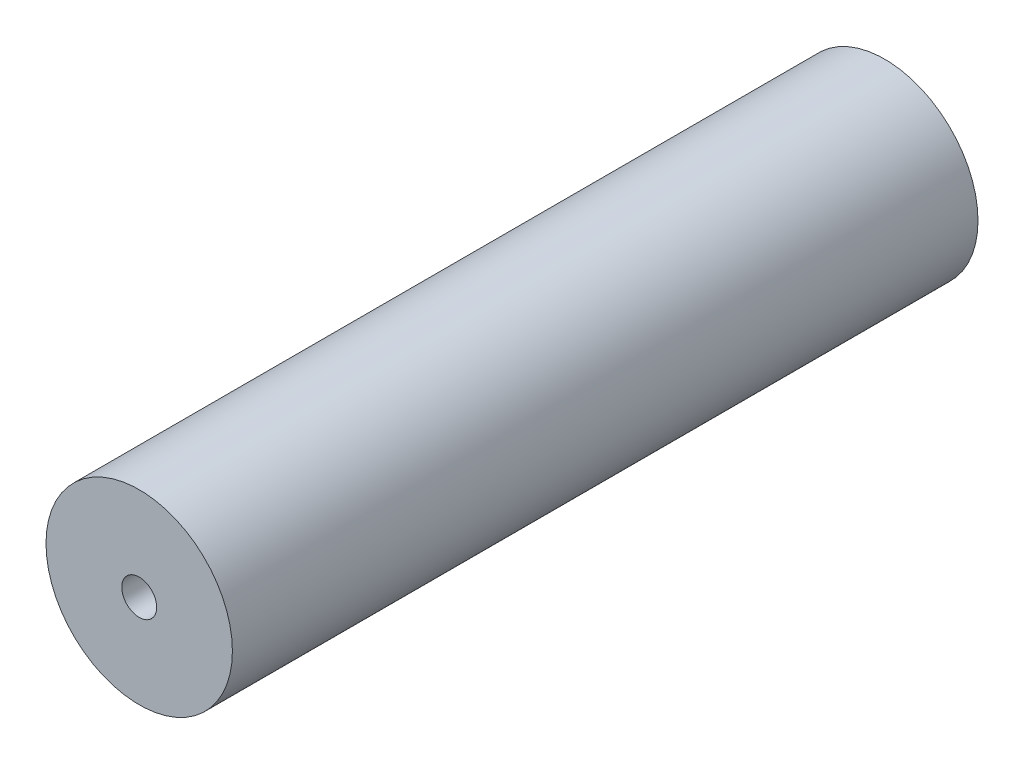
from build123d import *

# Parameters (mm, degrees)
SKETCH1_R      = 50.8
SKETCH1_R_2    = 9.525
EXTRUDE1_DEPTH = 203.2


with BuildPart() as part:
    # Sketch1 → Extrude1 (new, symmetric)
    with BuildSketch(Plane.XY):
        Circle(SKETCH1_R)
        Circle(SKETCH1_R_2, mode=Mode.SUBTRACT)
    extrude(amount=EXTRUDE1_DEPTH, both=True)


solid = part.part
